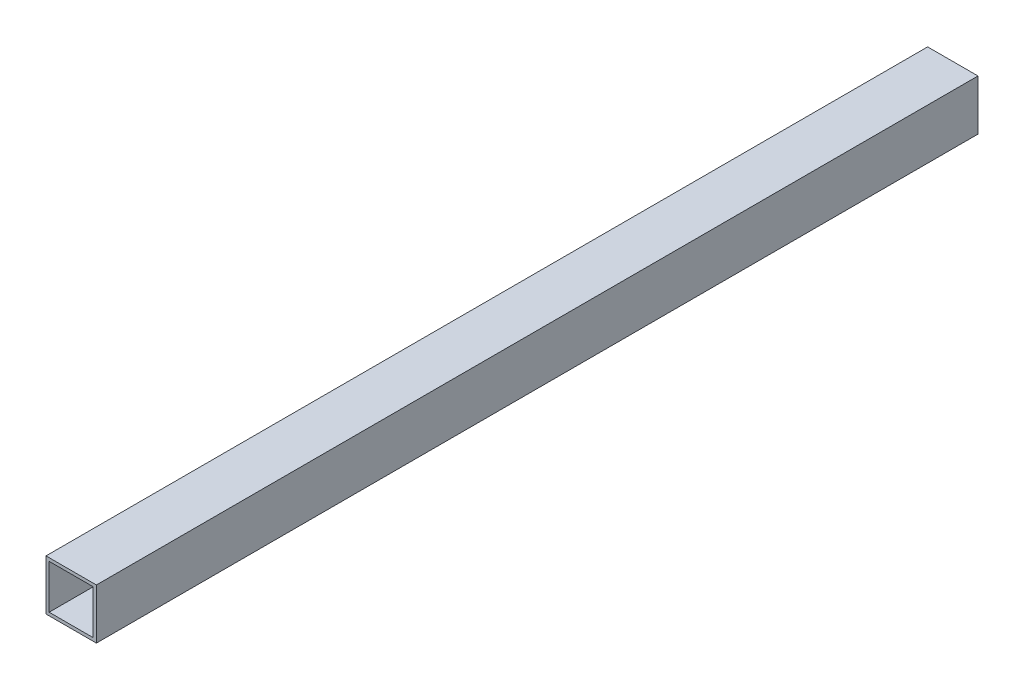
ISO-10303-21;
HEADER;
FILE_DESCRIPTION(('STEP AP214'),'2;1');
FILE_NAME('part.step','',(''),(''),'','','');
FILE_SCHEMA(('AUTOMOTIVE_DESIGN { 1 0 10303 214 1 1 1 1 }'));
ENDSEC;
DATA;
#1=APPLICATION_CONTEXT('core data for automotive mechanical design processes');
#2=APPLICATION_PROTOCOL_DEFINITION('international standard','automotive_design',2000,#1);
#3=PRODUCT_CONTEXT('',#1,'mechanical');
#4=PRODUCT('Part','Part','',(#3));
#5=PRODUCT_RELATED_PRODUCT_CATEGORY('part','',(#4));
#6=PRODUCT_DEFINITION_FORMATION('','',#4);
#7=PRODUCT_DEFINITION_CONTEXT('part definition',#1,'design');
#8=PRODUCT_DEFINITION('design','',#6,#7);
#9=PRODUCT_DEFINITION_SHAPE('','',#8);
#10=(LENGTH_UNIT() NAMED_UNIT(*) SI_UNIT(.MILLI.,.METRE.));
#11=(NAMED_UNIT(*) PLANE_ANGLE_UNIT() SI_UNIT($,.RADIAN.));
#12=(NAMED_UNIT(*) SI_UNIT($,.STERADIAN.) SOLID_ANGLE_UNIT());
#13=UNCERTAINTY_MEASURE_WITH_UNIT(LENGTH_MEASURE(1.E-05),#10,'distance_accuracy_value','');
#14=(GEOMETRIC_REPRESENTATION_CONTEXT(3) GLOBAL_UNCERTAINTY_ASSIGNED_CONTEXT((#13)) GLOBAL_UNIT_ASSIGNED_CONTEXT((#10,
#11,#12)) REPRESENTATION_CONTEXT('',''));
#15=CARTESIAN_POINT('',(0.,0.,0.));
#16=DIRECTION('',(0.,0.,1.));
#17=DIRECTION('',(1.,0.,0.));
#18=AXIS2_PLACEMENT_3D('',#15,#16,#17);
#19=CARTESIAN_POINT('',(0.,0.,444.5));
#20=DIRECTION('',(0.,0.,-1.));
#21=DIRECTION('',(-1.,0.,0.));
#22=AXIS2_PLACEMENT_3D('',#19,#20,#21);
#23=PLANE('',#22);
#24=DIRECTION('',(0.,-1.,0.));
#25=VECTOR('',#24,1.);
#26=CARTESIAN_POINT('',(0.,0.,444.5));
#27=LINE('',#26,#25);
#28=CARTESIAN_POINT('',(0.,25.4,444.5));
#29=VERTEX_POINT('',#28);
#30=CARTESIAN_POINT('',(0.,0.,444.5));
#31=VERTEX_POINT('',#30);
#32=EDGE_CURVE('E136',#29,#31,#27,.T.);
#33=ORIENTED_EDGE('',*,*,#32,.T.);
#34=DIRECTION('',(1.,0.,0.));
#35=VECTOR('',#34,1.);
#36=CARTESIAN_POINT('',(0.,0.,444.5));
#37=LINE('',#36,#35);
#38=CARTESIAN_POINT('',(25.4,0.,444.5));
#39=VERTEX_POINT('',#38);
#40=EDGE_CURVE('E139',#31,#39,#37,.T.);
#41=ORIENTED_EDGE('',*,*,#40,.T.);
#42=DIRECTION('',(0.,1.,0.));
#43=VECTOR('',#42,1.);
#44=CARTESIAN_POINT('',(25.4,0.,444.5));
#45=LINE('',#44,#43);
#46=CARTESIAN_POINT('',(25.4,25.4,444.5));
#47=VERTEX_POINT('',#46);
#48=EDGE_CURVE('E142',#39,#47,#45,.T.);
#49=ORIENTED_EDGE('',*,*,#48,.T.);
#50=DIRECTION('',(-1.,0.,0.));
#51=VECTOR('',#50,1.);
#52=CARTESIAN_POINT('',(0.,25.4,444.5));
#53=LINE('',#52,#51);
#54=EDGE_CURVE('E144',#47,#29,#53,.T.);
#55=ORIENTED_EDGE('',*,*,#54,.T.);
#56=EDGE_LOOP('',(#33,#41,#49,#55));
#57=FACE_BOUND('',#56,.T.);
#58=DIRECTION('',(0.,-1.,0.));
#59=VECTOR('',#58,1.);
#60=CARTESIAN_POINT('',(1.5875,1.5875,444.5));
#61=LINE('',#60,#59);
#62=CARTESIAN_POINT('',(1.5875,23.8125,444.5));
#63=VERTEX_POINT('',#62);
#64=CARTESIAN_POINT('',(1.5875,1.5875,444.5));
#65=VERTEX_POINT('',#64);
#66=EDGE_CURVE('E100',#63,#65,#61,.T.);
#67=ORIENTED_EDGE('',*,*,#66,.F.);
#68=DIRECTION('',(-1.,0.,0.));
#69=VECTOR('',#68,1.);
#70=CARTESIAN_POINT('',(1.5875,23.8125,444.5));
#71=LINE('',#70,#69);
#72=CARTESIAN_POINT('',(23.8125,23.8125,444.5));
#73=VERTEX_POINT('',#72);
#74=EDGE_CURVE('E122',#73,#63,#71,.T.);
#75=ORIENTED_EDGE('',*,*,#74,.F.);
#76=DIRECTION('',(0.,1.,0.));
#77=VECTOR('',#76,1.);
#78=CARTESIAN_POINT('',(23.8125,1.5875,444.5));
#79=LINE('',#78,#77);
#80=CARTESIAN_POINT('',(23.8125,1.5875,444.5));
#81=VERTEX_POINT('',#80);
#82=EDGE_CURVE('E120',#81,#73,#79,.T.);
#83=ORIENTED_EDGE('',*,*,#82,.F.);
#84=DIRECTION('',(1.,0.,0.));
#85=VECTOR('',#84,1.);
#86=CARTESIAN_POINT('',(1.5875,1.5875,444.5));
#87=LINE('',#86,#85);
#88=EDGE_CURVE('E108',#65,#81,#87,.T.);
#89=ORIENTED_EDGE('',*,*,#88,.F.);
#90=EDGE_LOOP('',(#67,#75,#83,#89));
#91=FACE_BOUND('',#90,.T.);
#92=ADVANCED_FACE('F35',(#57,#91),#23,.F.);
#93=CARTESIAN_POINT('',(0.,0.,0.));
#94=DIRECTION('',(0.,0.,-1.));
#95=DIRECTION('',(-1.,0.,0.));
#96=AXIS2_PLACEMENT_3D('',#93,#94,#95);
#97=PLANE('',#96);
#98=DIRECTION('',(0.,-1.,0.));
#99=VECTOR('',#98,1.);
#100=CARTESIAN_POINT('',(0.,0.,0.));
#101=LINE('',#100,#99);
#102=CARTESIAN_POINT('',(0.,25.4,0.));
#103=VERTEX_POINT('',#102);
#104=CARTESIAN_POINT('',(0.,0.,0.));
#105=VERTEX_POINT('',#104);
#106=EDGE_CURVE('E116',#103,#105,#101,.T.);
#107=ORIENTED_EDGE('',*,*,#106,.F.);
#108=DIRECTION('',(-1.,0.,0.));
#109=VECTOR('',#108,1.);
#110=CARTESIAN_POINT('',(0.,25.4,0.));
#111=LINE('',#110,#109);
#112=CARTESIAN_POINT('',(25.4,25.4,0.));
#113=VERTEX_POINT('',#112);
#114=EDGE_CURVE('E140',#113,#103,#111,.T.);
#115=ORIENTED_EDGE('',*,*,#114,.F.);
#116=DIRECTION('',(0.,1.,0.));
#117=VECTOR('',#116,1.);
#118=CARTESIAN_POINT('',(25.4,0.,0.));
#119=LINE('',#118,#117);
#120=CARTESIAN_POINT('',(25.4,0.,0.));
#121=VERTEX_POINT('',#120);
#122=EDGE_CURVE('E151',#121,#113,#119,.T.);
#123=ORIENTED_EDGE('',*,*,#122,.F.);
#124=DIRECTION('',(1.,0.,0.));
#125=VECTOR('',#124,1.);
#126=CARTESIAN_POINT('',(0.,0.,0.));
#127=LINE('',#126,#125);
#128=EDGE_CURVE('E149',#105,#121,#127,.T.);
#129=ORIENTED_EDGE('',*,*,#128,.F.);
#130=EDGE_LOOP('',(#107,#115,#123,#129));
#131=FACE_BOUND('',#130,.T.);
#132=DIRECTION('',(-1.,0.,0.));
#133=VECTOR('',#132,1.);
#134=CARTESIAN_POINT('',(1.5875,23.8125,0.));
#135=LINE('',#134,#133);
#136=CARTESIAN_POINT('',(23.8125,23.8125,0.));
#137=VERTEX_POINT('',#136);
#138=CARTESIAN_POINT('',(1.5875,23.8125,0.));
#139=VERTEX_POINT('',#138);
#140=EDGE_CURVE('E109',#137,#139,#135,.T.);
#141=ORIENTED_EDGE('',*,*,#140,.T.);
#142=DIRECTION('',(0.,-1.,0.));
#143=VECTOR('',#142,1.);
#144=CARTESIAN_POINT('',(1.5875,1.5875,0.));
#145=LINE('',#144,#143);
#146=CARTESIAN_POINT('',(1.5875,1.5875,0.));
#147=VERTEX_POINT('',#146);
#148=EDGE_CURVE('E58',#139,#147,#145,.T.);
#149=ORIENTED_EDGE('',*,*,#148,.T.);
#150=DIRECTION('',(1.,0.,0.));
#151=VECTOR('',#150,1.);
#152=CARTESIAN_POINT('',(1.5875,1.5875,0.));
#153=LINE('',#152,#151);
#154=CARTESIAN_POINT('',(23.8125,1.5875,0.));
#155=VERTEX_POINT('',#154);
#156=EDGE_CURVE('E115',#147,#155,#153,.T.);
#157=ORIENTED_EDGE('',*,*,#156,.T.);
#158=DIRECTION('',(0.,1.,0.));
#159=VECTOR('',#158,1.);
#160=CARTESIAN_POINT('',(23.8125,1.5875,0.));
#161=LINE('',#160,#159);
#162=EDGE_CURVE('E128',#155,#137,#161,.T.);
#163=ORIENTED_EDGE('',*,*,#162,.T.);
#164=EDGE_LOOP('',(#141,#149,#157,#163));
#165=FACE_BOUND('',#164,.T.);
#166=ADVANCED_FACE('F169',(#131,#165),#97,.T.);
#167=CARTESIAN_POINT('',(0.,0.,444.5));
#168=DIRECTION('',(1.,0.,0.));
#169=DIRECTION('',(0.,0.,-1.));
#170=AXIS2_PLACEMENT_3D('',#167,#168,#169);
#171=PLANE('',#170);
#172=ORIENTED_EDGE('',*,*,#106,.T.);
#173=DIRECTION('',(0.,0.,-1.));
#174=VECTOR('',#173,1.);
#175=CARTESIAN_POINT('',(0.,0.,444.5));
#176=LINE('',#175,#174);
#177=EDGE_CURVE('E11',#31,#105,#176,.T.);
#178=ORIENTED_EDGE('',*,*,#177,.F.);
#179=ORIENTED_EDGE('',*,*,#32,.F.);
#180=DIRECTION('',(0.,0.,-1.));
#181=VECTOR('',#180,1.);
#182=CARTESIAN_POINT('',(0.,25.4,444.5));
#183=LINE('',#182,#181);
#184=EDGE_CURVE('E146',#29,#103,#183,.T.);
#185=ORIENTED_EDGE('',*,*,#184,.T.);
#186=EDGE_LOOP('',(#172,#178,#179,#185));
#187=FACE_BOUND('',#186,.T.);
#188=ADVANCED_FACE('F37',(#187),#171,.F.);
#189=CARTESIAN_POINT('',(0.,0.,444.5));
#190=DIRECTION('',(0.,1.,0.));
#191=DIRECTION('',(0.,0.,1.));
#192=AXIS2_PLACEMENT_3D('',#189,#190,#191);
#193=PLANE('',#192);
#194=ORIENTED_EDGE('',*,*,#128,.T.);
#195=DIRECTION('',(0.,0.,-1.));
#196=VECTOR('',#195,1.);
#197=CARTESIAN_POINT('',(25.4,0.,444.5));
#198=LINE('',#197,#196);
#199=EDGE_CURVE('E43',#39,#121,#198,.T.);
#200=ORIENTED_EDGE('',*,*,#199,.F.);
#201=ORIENTED_EDGE('',*,*,#40,.F.);
#202=ORIENTED_EDGE('',*,*,#177,.T.);
#203=EDGE_LOOP('',(#194,#200,#201,#202));
#204=FACE_BOUND('',#203,.T.);
#205=ADVANCED_FACE('F179',(#204),#193,.F.);
#206=CARTESIAN_POINT('',(25.4,0.,444.5));
#207=DIRECTION('',(-1.,0.,0.));
#208=DIRECTION('',(0.,0.,1.));
#209=AXIS2_PLACEMENT_3D('',#206,#207,#208);
#210=PLANE('',#209);
#211=ORIENTED_EDGE('',*,*,#122,.T.);
#212=DIRECTION('',(0.,0.,-1.));
#213=VECTOR('',#212,1.);
#214=CARTESIAN_POINT('',(25.4,25.4,444.5));
#215=LINE('',#214,#213);
#216=EDGE_CURVE('E156',#47,#113,#215,.T.);
#217=ORIENTED_EDGE('',*,*,#216,.F.);
#218=ORIENTED_EDGE('',*,*,#48,.F.);
#219=ORIENTED_EDGE('',*,*,#199,.T.);
#220=EDGE_LOOP('',(#211,#217,#218,#219));
#221=FACE_BOUND('',#220,.T.);
#222=ADVANCED_FACE('F163',(#221),#210,.F.);
#223=CARTESIAN_POINT('',(0.,25.4,444.5));
#224=DIRECTION('',(0.,-1.,0.));
#225=DIRECTION('',(0.,0.,-1.));
#226=AXIS2_PLACEMENT_3D('',#223,#224,#225);
#227=PLANE('',#226);
#228=ORIENTED_EDGE('',*,*,#114,.T.);
#229=ORIENTED_EDGE('',*,*,#184,.F.);
#230=ORIENTED_EDGE('',*,*,#54,.F.);
#231=ORIENTED_EDGE('',*,*,#216,.T.);
#232=EDGE_LOOP('',(#228,#229,#230,#231));
#233=FACE_BOUND('',#232,.T.);
#234=ADVANCED_FACE('F173',(#233),#227,.F.);
#235=CARTESIAN_POINT('',(1.5875,1.5875,444.5));
#236=DIRECTION('',(1.,0.,0.));
#237=DIRECTION('',(0.,0.,-1.));
#238=AXIS2_PLACEMENT_3D('',#235,#236,#237);
#239=PLANE('',#238);
#240=ORIENTED_EDGE('',*,*,#148,.F.);
#241=DIRECTION('',(0.,0.,-1.));
#242=VECTOR('',#241,1.);
#243=CARTESIAN_POINT('',(1.5875,23.8125,444.5));
#244=LINE('',#243,#242);
#245=EDGE_CURVE('E104',#63,#139,#244,.T.);
#246=ORIENTED_EDGE('',*,*,#245,.F.);
#247=ORIENTED_EDGE('',*,*,#66,.T.);
#248=DIRECTION('',(0.,0.,-1.));
#249=VECTOR('',#248,1.);
#250=CARTESIAN_POINT('',(1.5875,1.5875,444.5));
#251=LINE('',#250,#249);
#252=EDGE_CURVE('E103',#65,#147,#251,.T.);
#253=ORIENTED_EDGE('',*,*,#252,.T.);
#254=EDGE_LOOP('',(#240,#246,#247,#253));
#255=FACE_BOUND('',#254,.T.);
#256=ADVANCED_FACE('F102',(#255),#239,.T.);
#257=CARTESIAN_POINT('',(1.5875,1.5875,444.5));
#258=DIRECTION('',(0.,1.,0.));
#259=DIRECTION('',(0.,0.,1.));
#260=AXIS2_PLACEMENT_3D('',#257,#258,#259);
#261=PLANE('',#260);
#262=ORIENTED_EDGE('',*,*,#156,.F.);
#263=ORIENTED_EDGE('',*,*,#252,.F.);
#264=ORIENTED_EDGE('',*,*,#88,.T.);
#265=DIRECTION('',(0.,0.,-1.));
#266=VECTOR('',#265,1.);
#267=CARTESIAN_POINT('',(23.8125,1.5875,444.5));
#268=LINE('',#267,#266);
#269=EDGE_CURVE('E117',#81,#155,#268,.T.);
#270=ORIENTED_EDGE('',*,*,#269,.T.);
#271=EDGE_LOOP('',(#262,#263,#264,#270));
#272=FACE_BOUND('',#271,.T.);
#273=ADVANCED_FACE('F112',(#272),#261,.T.);
#274=CARTESIAN_POINT('',(23.8125,1.5875,444.5));
#275=DIRECTION('',(-1.,0.,0.));
#276=DIRECTION('',(0.,0.,1.));
#277=AXIS2_PLACEMENT_3D('',#274,#275,#276);
#278=PLANE('',#277);
#279=ORIENTED_EDGE('',*,*,#162,.F.);
#280=ORIENTED_EDGE('',*,*,#269,.F.);
#281=ORIENTED_EDGE('',*,*,#82,.T.);
#282=DIRECTION('',(0.,0.,-1.));
#283=VECTOR('',#282,1.);
#284=CARTESIAN_POINT('',(23.8125,23.8125,444.5));
#285=LINE('',#284,#283);
#286=EDGE_CURVE('E50',#73,#137,#285,.T.);
#287=ORIENTED_EDGE('',*,*,#286,.T.);
#288=EDGE_LOOP('',(#279,#280,#281,#287));
#289=FACE_BOUND('',#288,.T.);
#290=ADVANCED_FACE('F202',(#289),#278,.T.);
#291=CARTESIAN_POINT('',(1.5875,23.8125,444.5));
#292=DIRECTION('',(0.,-1.,0.));
#293=DIRECTION('',(0.,0.,-1.));
#294=AXIS2_PLACEMENT_3D('',#291,#292,#293);
#295=PLANE('',#294);
#296=ORIENTED_EDGE('',*,*,#140,.F.);
#297=ORIENTED_EDGE('',*,*,#286,.F.);
#298=ORIENTED_EDGE('',*,*,#74,.T.);
#299=ORIENTED_EDGE('',*,*,#245,.T.);
#300=EDGE_LOOP('',(#296,#297,#298,#299));
#301=FACE_BOUND('',#300,.T.);
#302=ADVANCED_FACE('F206',(#301),#295,.T.);
#303=CLOSED_SHELL('',(#92,#166,#188,#205,#222,#234,#256,#273,#290,#302));
#304=MANIFOLD_SOLID_BREP('B2',#303);
#305=ADVANCED_BREP_SHAPE_REPRESENTATION('',(#18,#304),#14);
#306=SHAPE_DEFINITION_REPRESENTATION(#9,#305);
ENDSEC;
END-ISO-10303-21;
